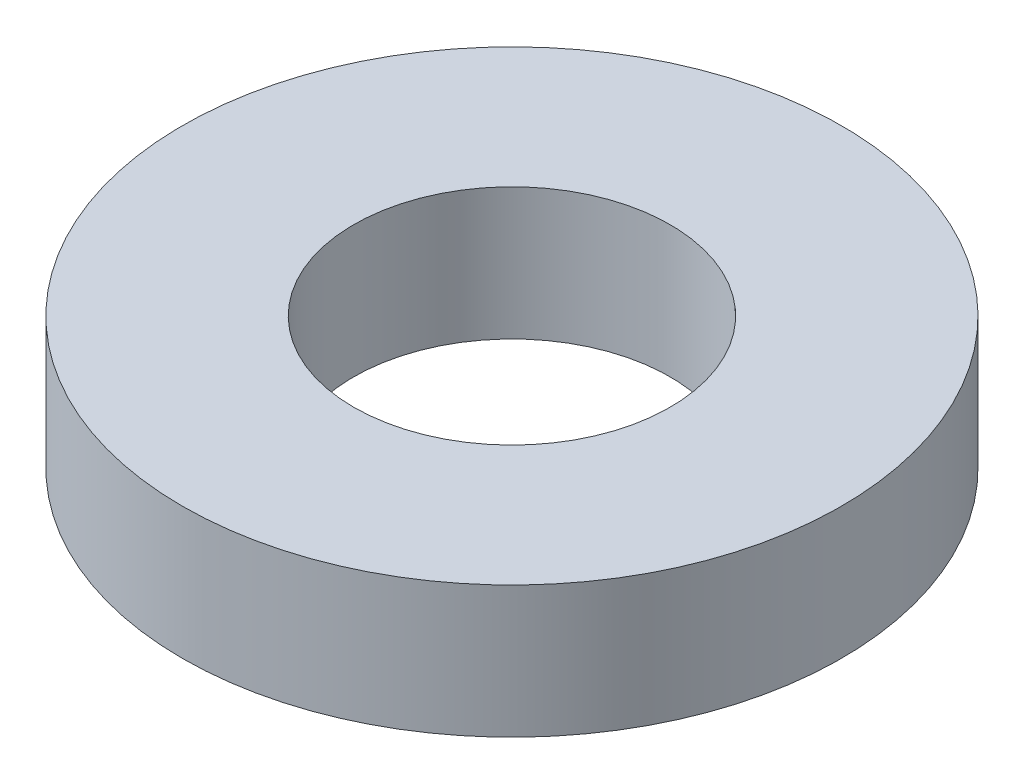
ISO-10303-21;
HEADER;
FILE_DESCRIPTION(('STEP AP214'),'2;1');
FILE_NAME('part.step','',(''),(''),'','','');
FILE_SCHEMA(('AUTOMOTIVE_DESIGN { 1 0 10303 214 1 1 1 1 }'));
ENDSEC;
DATA;
#1=APPLICATION_CONTEXT('core data for automotive mechanical design processes');
#2=APPLICATION_PROTOCOL_DEFINITION('international standard','automotive_design',2000,#1);
#3=PRODUCT_CONTEXT('',#1,'mechanical');
#4=PRODUCT('Part','Part','',(#3));
#5=PRODUCT_RELATED_PRODUCT_CATEGORY('part','',(#4));
#6=PRODUCT_DEFINITION_FORMATION('','',#4);
#7=PRODUCT_DEFINITION_CONTEXT('part definition',#1,'design');
#8=PRODUCT_DEFINITION('design','',#6,#7);
#9=PRODUCT_DEFINITION_SHAPE('','',#8);
#10=(LENGTH_UNIT() NAMED_UNIT(*) SI_UNIT(.MILLI.,.METRE.));
#11=(NAMED_UNIT(*) PLANE_ANGLE_UNIT() SI_UNIT($,.RADIAN.));
#12=(NAMED_UNIT(*) SI_UNIT($,.STERADIAN.) SOLID_ANGLE_UNIT());
#13=UNCERTAINTY_MEASURE_WITH_UNIT(LENGTH_MEASURE(1.E-05),#10,'distance_accuracy_value','');
#14=(GEOMETRIC_REPRESENTATION_CONTEXT(3) GLOBAL_UNCERTAINTY_ASSIGNED_CONTEXT((#13)) GLOBAL_UNIT_ASSIGNED_CONTEXT((#10,
#11,#12)) REPRESENTATION_CONTEXT('',''));
#15=CARTESIAN_POINT('',(0.,0.,0.));
#16=DIRECTION('',(0.,0.,1.));
#17=DIRECTION('',(1.,0.,0.));
#18=AXIS2_PLACEMENT_3D('',#15,#16,#17);
#19=CARTESIAN_POINT('',(0.,20.,0.));
#20=DIRECTION('',(0.,1.,0.));
#21=DIRECTION('',(0.,0.,1.));
#22=AXIS2_PLACEMENT_3D('',#19,#20,#21);
#23=PLANE('',#22);
#24=CARTESIAN_POINT('',(0.,20.,0.));
#25=DIRECTION('',(0.,1.,0.));
#26=DIRECTION('',(0.,0.,1.));
#27=AXIS2_PLACEMENT_3D('',#24,#25,#26);
#28=CIRCLE('',#27,50.);
#29=CARTESIAN_POINT('',(0.,20.,50.));
#30=VERTEX_POINT('',#29);
#31=EDGE_CURVE('E10',#30,#30,#28,.T.);
#32=ORIENTED_EDGE('',*,*,#31,.T.);
#33=EDGE_LOOP('',(#32));
#34=FACE_BOUND('',#33,.T.);
#35=CARTESIAN_POINT('',(0.,20.,0.));
#36=DIRECTION('',(0.,1.,0.));
#37=DIRECTION('',(0.,0.,1.));
#38=AXIS2_PLACEMENT_3D('',#35,#36,#37);
#39=CIRCLE('',#38,24.);
#40=CARTESIAN_POINT('',(0.,20.,24.));
#41=VERTEX_POINT('',#40);
#42=EDGE_CURVE('E39',#41,#41,#39,.T.);
#43=ORIENTED_EDGE('',*,*,#42,.F.);
#44=EDGE_LOOP('',(#43));
#45=FACE_BOUND('',#44,.T.);
#46=ADVANCED_FACE('F28',(#34,#45),#23,.T.);
#47=CARTESIAN_POINT('',(0.,0.,0.));
#48=DIRECTION('',(0.,1.,0.));
#49=DIRECTION('',(0.,0.,1.));
#50=AXIS2_PLACEMENT_3D('',#47,#48,#49);
#51=PLANE('',#50);
#52=CARTESIAN_POINT('',(0.,0.,0.));
#53=DIRECTION('',(0.,1.,0.));
#54=DIRECTION('',(0.,0.,1.));
#55=AXIS2_PLACEMENT_3D('',#52,#53,#54);
#56=CIRCLE('',#55,50.);
#57=CARTESIAN_POINT('',(0.,0.,50.));
#58=VERTEX_POINT('',#57);
#59=EDGE_CURVE('E35',#58,#58,#56,.T.);
#60=ORIENTED_EDGE('',*,*,#59,.F.);
#61=EDGE_LOOP('',(#60));
#62=FACE_BOUND('',#61,.T.);
#63=CARTESIAN_POINT('',(0.,0.,0.));
#64=DIRECTION('',(0.,1.,0.));
#65=DIRECTION('',(0.,0.,1.));
#66=AXIS2_PLACEMENT_3D('',#63,#64,#65);
#67=CIRCLE('',#66,24.);
#68=CARTESIAN_POINT('',(0.,0.,24.));
#69=VERTEX_POINT('',#68);
#70=EDGE_CURVE('E43',#69,#69,#67,.T.);
#71=ORIENTED_EDGE('',*,*,#70,.T.);
#72=EDGE_LOOP('',(#71));
#73=FACE_BOUND('',#72,.T.);
#74=ADVANCED_FACE('F49',(#62,#73),#51,.F.);
#75=CARTESIAN_POINT('',(0.,20.,0.));
#76=DIRECTION('',(0.,-1.,0.));
#77=DIRECTION('',(0.,0.,-1.));
#78=AXIS2_PLACEMENT_3D('',#75,#76,#77);
#79=CYLINDRICAL_SURFACE('',#78,50.);
#80=ORIENTED_EDGE('',*,*,#31,.F.);
#81=EDGE_LOOP('',(#80));
#82=FACE_BOUND('',#81,.T.);
#83=ORIENTED_EDGE('',*,*,#59,.T.);
#84=EDGE_LOOP('',(#83));
#85=FACE_BOUND('',#84,.T.);
#86=ADVANCED_FACE('F30',(#82,#85),#79,.T.);
#87=CARTESIAN_POINT('',(0.,20.,0.));
#88=DIRECTION('',(0.,-1.,0.));
#89=DIRECTION('',(0.,0.,-1.));
#90=AXIS2_PLACEMENT_3D('',#87,#88,#89);
#91=CYLINDRICAL_SURFACE('',#90,24.);
#92=ORIENTED_EDGE('',*,*,#42,.T.);
#93=EDGE_LOOP('',(#92));
#94=FACE_BOUND('',#93,.T.);
#95=ORIENTED_EDGE('',*,*,#70,.F.);
#96=EDGE_LOOP('',(#95));
#97=FACE_BOUND('',#96,.T.);
#98=ADVANCED_FACE('F51',(#94,#97),#91,.F.);
#99=CLOSED_SHELL('',(#46,#74,#86,#98));
#100=MANIFOLD_SOLID_BREP('B2',#99);
#101=ADVANCED_BREP_SHAPE_REPRESENTATION('',(#18,#100),#14);
#102=SHAPE_DEFINITION_REPRESENTATION(#9,#101);
ENDSEC;
END-ISO-10303-21;
